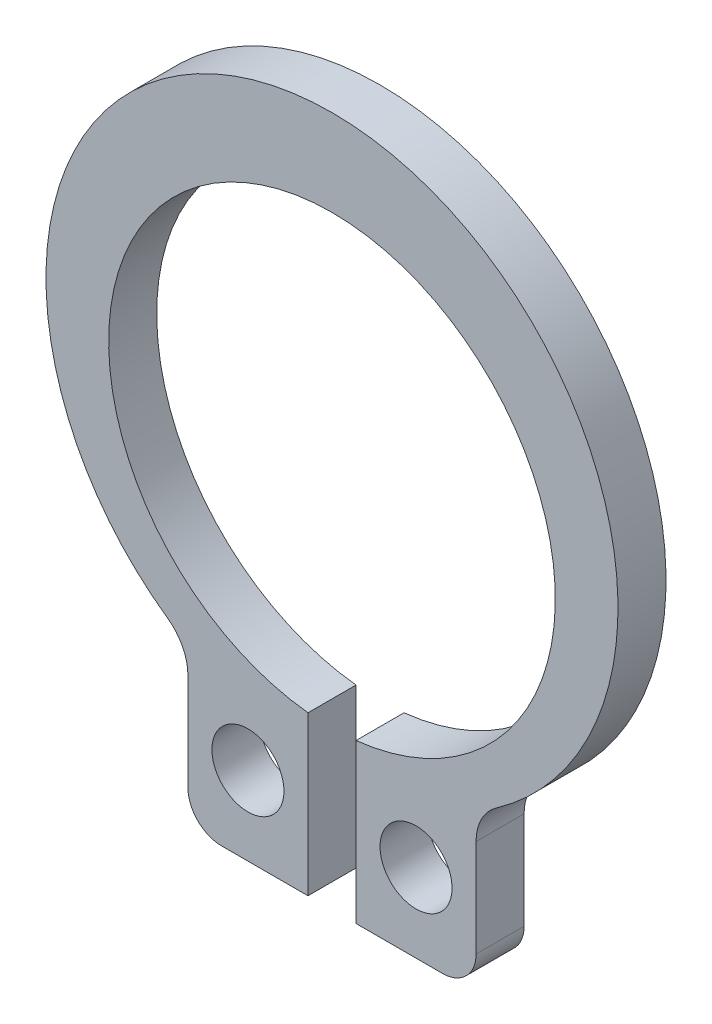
ISO-10303-21;
HEADER;
FILE_DESCRIPTION(('STEP AP214'),'2;1');
FILE_NAME('part.step','',(''),(''),'','','');
FILE_SCHEMA(('AUTOMOTIVE_DESIGN { 1 0 10303 214 1 1 1 1 }'));
ENDSEC;
DATA;
#1=APPLICATION_CONTEXT('core data for automotive mechanical design processes');
#2=APPLICATION_PROTOCOL_DEFINITION('international standard','automotive_design',2000,#1);
#3=PRODUCT_CONTEXT('',#1,'mechanical');
#4=PRODUCT('Part','Part','',(#3));
#5=PRODUCT_RELATED_PRODUCT_CATEGORY('part','',(#4));
#6=PRODUCT_DEFINITION_FORMATION('','',#4);
#7=PRODUCT_DEFINITION_CONTEXT('part definition',#1,'design');
#8=PRODUCT_DEFINITION('design','',#6,#7);
#9=PRODUCT_DEFINITION_SHAPE('','',#8);
#10=(LENGTH_UNIT() NAMED_UNIT(*) SI_UNIT(.MILLI.,.METRE.));
#11=(NAMED_UNIT(*) PLANE_ANGLE_UNIT() SI_UNIT($,.RADIAN.));
#12=(NAMED_UNIT(*) SI_UNIT($,.STERADIAN.) SOLID_ANGLE_UNIT());
#13=UNCERTAINTY_MEASURE_WITH_UNIT(LENGTH_MEASURE(1.E-05),#10,'distance_accuracy_value','');
#14=(GEOMETRIC_REPRESENTATION_CONTEXT(3) GLOBAL_UNCERTAINTY_ASSIGNED_CONTEXT((#13)) GLOBAL_UNIT_ASSIGNED_CONTEXT((#10,
#11,#12)) REPRESENTATION_CONTEXT('',''));
#15=CARTESIAN_POINT('',(0.,0.,0.));
#16=DIRECTION('',(0.,0.,1.));
#17=DIRECTION('',(1.,0.,0.));
#18=AXIS2_PLACEMENT_3D('',#15,#16,#17);
#19=CARTESIAN_POINT('',(0.,0.,1.));
#20=DIRECTION('',(0.,0.,1.));
#21=DIRECTION('',(1.,0.,0.));
#22=AXIS2_PLACEMENT_3D('',#19,#20,#21);
#23=PLANE('',#22);
#24=CARTESIAN_POINT('',(-1.75,-6.28608270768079,1.));
#25=DIRECTION('',(0.,0.,1.));
#26=DIRECTION('',(1.,0.,0.));
#27=AXIS2_PLACEMENT_3D('',#24,#25,#26);
#28=CIRCLE('',#27,0.75);
#29=CARTESIAN_POINT('',(-0.999999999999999,-6.28608270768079,1.));
#30=VERTEX_POINT('',#29);
#31=EDGE_CURVE('E216',#30,#30,#28,.T.);
#32=ORIENTED_EDGE('',*,*,#31,.F.);
#33=EDGE_LOOP('',(#32));
#34=FACE_BOUND('',#33,.T.);
#35=DIRECTION('',(1.,0.,0.));
#36=VECTOR('',#35,1.);
#37=CARTESIAN_POINT('',(0.500000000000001,-7.92304012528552,1.));
#38=LINE('',#37,#36);
#39=CARTESIAN_POINT('',(0.500000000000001,-7.92304012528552,1.));
#40=VERTEX_POINT('',#39);
#41=CARTESIAN_POINT('',(2.3,-7.92304012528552,1.));
#42=VERTEX_POINT('',#41);
#43=EDGE_CURVE('E132',#40,#42,#38,.T.);
#44=ORIENTED_EDGE('',*,*,#43,.T.);
#45=CARTESIAN_POINT('',(2.3,-7.22304012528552,1.));
#46=DIRECTION('',(0.,0.,1.));
#47=DIRECTION('',(1.,0.,0.));
#48=AXIS2_PLACEMENT_3D('',#45,#46,#47);
#49=CIRCLE('',#48,0.7);
#50=CARTESIAN_POINT('',(3.,-7.22304012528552,1.));
#51=VERTEX_POINT('',#50);
#52=EDGE_CURVE('E182',#42,#51,#49,.T.);
#53=ORIENTED_EDGE('',*,*,#52,.T.);
#54=DIRECTION('',(0.,1.,0.));
#55=VECTOR('',#54,1.);
#56=CARTESIAN_POINT('',(3.,-7.92304012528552,1.));
#57=LINE('',#56,#55);
#58=CARTESIAN_POINT('',(3.,-5.19464190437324,1.));
#59=VERTEX_POINT('',#58);
#60=EDGE_CURVE('E236',#51,#59,#57,.T.);
#61=ORIENTED_EDGE('',*,*,#60,.T.);
#62=CARTESIAN_POINT('',(4.,-5.19464190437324,1.));
#63=DIRECTION('',(0.,0.,1.));
#64=DIRECTION('',(1.,0.,0.));
#65=AXIS2_PLACEMENT_3D('',#62,#63,#64);
#66=CIRCLE('',#65,1.);
#67=CARTESIAN_POINT('',(3.42487419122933,-4.37657692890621,1.));
#68=VERTEX_POINT('',#67);
#69=EDGE_CURVE('E166',#59,#68,#66,.F.);
#70=ORIENTED_EDGE('',*,*,#69,.T.);
#71=CARTESIAN_POINT('',(0.,0.495,1.));
#72=DIRECTION('',(0.,0.,1.));
#73=DIRECTION('',(1.,0.,0.));
#74=AXIS2_PLACEMENT_3D('',#71,#72,#73);
#75=CIRCLE('',#74,5.955);
#76=CARTESIAN_POINT('',(-3.42487419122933,-4.37657692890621,1.));
#77=VERTEX_POINT('',#76);
#78=EDGE_CURVE('E234',#68,#77,#75,.T.);
#79=ORIENTED_EDGE('',*,*,#78,.T.);
#80=CARTESIAN_POINT('',(-4.,-5.19464190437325,1.));
#81=DIRECTION('',(0.,0.,1.));
#82=DIRECTION('',(1.,0.,0.));
#83=AXIS2_PLACEMENT_3D('',#80,#81,#82);
#84=CIRCLE('',#83,1.);
#85=CARTESIAN_POINT('',(-3.,-5.19464190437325,1.));
#86=VERTEX_POINT('',#85);
#87=EDGE_CURVE('E170',#77,#86,#84,.F.);
#88=ORIENTED_EDGE('',*,*,#87,.T.);
#89=DIRECTION('',(0.,-1.,0.));
#90=VECTOR('',#89,1.);
#91=CARTESIAN_POINT('',(-3.,-7.92304012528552,1.));
#92=LINE('',#91,#90);
#93=CARTESIAN_POINT('',(-3.,-7.22304012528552,1.));
#94=VERTEX_POINT('',#93);
#95=EDGE_CURVE('E210',#86,#94,#92,.T.);
#96=ORIENTED_EDGE('',*,*,#95,.T.);
#97=CARTESIAN_POINT('',(-2.3,-7.22304012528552,1.));
#98=DIRECTION('',(0.,0.,1.));
#99=DIRECTION('',(1.,0.,0.));
#100=AXIS2_PLACEMENT_3D('',#97,#98,#99);
#101=CIRCLE('',#100,0.7);
#102=CARTESIAN_POINT('',(-2.3,-7.92304012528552,1.));
#103=VERTEX_POINT('',#102);
#104=EDGE_CURVE('E48',#94,#103,#101,.T.);
#105=ORIENTED_EDGE('',*,*,#104,.T.);
#106=DIRECTION('',(1.,0.,0.));
#107=VECTOR('',#106,1.);
#108=CARTESIAN_POINT('',(-0.499999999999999,-7.92304012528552,1.));
#109=LINE('',#108,#107);
#110=CARTESIAN_POINT('',(-0.499999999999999,-7.92304012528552,1.));
#111=VERTEX_POINT('',#110);
#112=EDGE_CURVE('E191',#103,#111,#109,.T.);
#113=ORIENTED_EDGE('',*,*,#112,.T.);
#114=DIRECTION('',(0.,1.,0.));
#115=VECTOR('',#114,1.);
#116=CARTESIAN_POINT('',(-0.499999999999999,-4.62304012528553,1.));
#117=LINE('',#116,#115);
#118=CARTESIAN_POINT('',(-0.499999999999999,-4.62304012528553,1.));
#119=VERTEX_POINT('',#118);
#120=EDGE_CURVE('E138',#111,#119,#117,.T.);
#121=ORIENTED_EDGE('',*,*,#120,.T.);
#122=CARTESIAN_POINT('',(0.,0.,1.));
#123=DIRECTION('',(0.,0.,-1.));
#124=DIRECTION('',(1.,0.,0.));
#125=AXIS2_PLACEMENT_3D('',#122,#123,#124);
#126=CIRCLE('',#125,4.65);
#127=CARTESIAN_POINT('',(0.499999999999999,-4.62304012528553,1.));
#128=VERTEX_POINT('',#127);
#129=EDGE_CURVE('E133',#119,#128,#126,.T.);
#130=ORIENTED_EDGE('',*,*,#129,.T.);
#131=DIRECTION('',(0.,-1.,0.));
#132=VECTOR('',#131,1.);
#133=CARTESIAN_POINT('',(0.499999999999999,-4.62304012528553,1.));
#134=LINE('',#133,#132);
#135=EDGE_CURVE('E122',#128,#40,#134,.T.);
#136=ORIENTED_EDGE('',*,*,#135,.T.);
#137=EDGE_LOOP('',(#44,#53,#61,#70,#79,#88,#96,#105,#113,#121,#130,#136));
#138=FACE_BOUND('',#137,.T.);
#139=CARTESIAN_POINT('',(1.75,-6.28608270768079,1.));
#140=DIRECTION('',(0.,0.,1.));
#141=DIRECTION('',(-1.,0.,0.));
#142=AXIS2_PLACEMENT_3D('',#139,#140,#141);
#143=CIRCLE('',#142,0.75);
#144=CARTESIAN_POINT('',(1.,-6.28608270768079,1.));
#145=VERTEX_POINT('',#144);
#146=EDGE_CURVE('E244',#145,#145,#143,.T.);
#147=ORIENTED_EDGE('',*,*,#146,.F.);
#148=EDGE_LOOP('',(#147));
#149=FACE_BOUND('',#148,.T.);
#150=ADVANCED_FACE('F33',(#34,#138,#149),#23,.T.);
#151=CARTESIAN_POINT('',(0.,0.,0.));
#152=DIRECTION('',(0.,0.,1.));
#153=DIRECTION('',(1.,0.,0.));
#154=AXIS2_PLACEMENT_3D('',#151,#152,#153);
#155=PLANE('',#154);
#156=DIRECTION('',(0.,1.,0.));
#157=VECTOR('',#156,1.);
#158=CARTESIAN_POINT('',(3.,-7.92304012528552,0.));
#159=LINE('',#158,#157);
#160=CARTESIAN_POINT('',(3.,-7.22304012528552,0.));
#161=VERTEX_POINT('',#160);
#162=CARTESIAN_POINT('',(3.,-5.19464190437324,0.));
#163=VERTEX_POINT('',#162);
#164=EDGE_CURVE('E221',#161,#163,#159,.T.);
#165=ORIENTED_EDGE('',*,*,#164,.F.);
#166=CARTESIAN_POINT('',(2.3,-7.22304012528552,0.));
#167=DIRECTION('',(0.,0.,1.));
#168=DIRECTION('',(1.,0.,0.));
#169=AXIS2_PLACEMENT_3D('',#166,#167,#168);
#170=CIRCLE('',#169,0.7);
#171=CARTESIAN_POINT('',(2.3,-7.92304012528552,0.));
#172=VERTEX_POINT('',#171);
#173=EDGE_CURVE('E177',#161,#172,#170,.F.);
#174=ORIENTED_EDGE('',*,*,#173,.T.);
#175=DIRECTION('',(1.,0.,0.));
#176=VECTOR('',#175,1.);
#177=CARTESIAN_POINT('',(0.500000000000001,-7.92304012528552,0.));
#178=LINE('',#177,#176);
#179=CARTESIAN_POINT('',(0.500000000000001,-7.92304012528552,0.));
#180=VERTEX_POINT('',#179);
#181=EDGE_CURVE('E218',#180,#172,#178,.T.);
#182=ORIENTED_EDGE('',*,*,#181,.F.);
#183=DIRECTION('',(0.,-1.,0.));
#184=VECTOR('',#183,1.);
#185=CARTESIAN_POINT('',(0.499999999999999,-4.62304012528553,0.));
#186=LINE('',#185,#184);
#187=CARTESIAN_POINT('',(0.499999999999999,-4.62304012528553,0.));
#188=VERTEX_POINT('',#187);
#189=EDGE_CURVE('E215',#188,#180,#186,.T.);
#190=ORIENTED_EDGE('',*,*,#189,.F.);
#191=CARTESIAN_POINT('',(0.,0.,0.));
#192=DIRECTION('',(0.,0.,-1.));
#193=DIRECTION('',(1.,0.,0.));
#194=AXIS2_PLACEMENT_3D('',#191,#192,#193);
#195=CIRCLE('',#194,4.65);
#196=CARTESIAN_POINT('',(-0.499999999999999,-4.62304012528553,0.));
#197=VERTEX_POINT('',#196);
#198=EDGE_CURVE('E146',#197,#188,#195,.T.);
#199=ORIENTED_EDGE('',*,*,#198,.F.);
#200=DIRECTION('',(0.,1.,0.));
#201=VECTOR('',#200,1.);
#202=CARTESIAN_POINT('',(-0.499999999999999,-4.62304012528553,0.));
#203=LINE('',#202,#201);
#204=CARTESIAN_POINT('',(-0.499999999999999,-7.92304012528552,0.));
#205=VERTEX_POINT('',#204);
#206=EDGE_CURVE('E142',#205,#197,#203,.T.);
#207=ORIENTED_EDGE('',*,*,#206,.F.);
#208=DIRECTION('',(1.,0.,0.));
#209=VECTOR('',#208,1.);
#210=CARTESIAN_POINT('',(-0.499999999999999,-7.92304012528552,0.));
#211=LINE('',#210,#209);
#212=CARTESIAN_POINT('',(-2.3,-7.92304012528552,0.));
#213=VERTEX_POINT('',#212);
#214=EDGE_CURVE('E189',#213,#205,#211,.T.);
#215=ORIENTED_EDGE('',*,*,#214,.F.);
#216=CARTESIAN_POINT('',(-2.3,-7.22304012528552,0.));
#217=DIRECTION('',(0.,0.,1.));
#218=DIRECTION('',(1.,0.,0.));
#219=AXIS2_PLACEMENT_3D('',#216,#217,#218);
#220=CIRCLE('',#219,0.7);
#221=CARTESIAN_POINT('',(-3.,-7.22304012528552,0.));
#222=VERTEX_POINT('',#221);
#223=EDGE_CURVE('E175',#213,#222,#220,.F.);
#224=ORIENTED_EDGE('',*,*,#223,.T.);
#225=DIRECTION('',(0.,-1.,0.));
#226=VECTOR('',#225,1.);
#227=CARTESIAN_POINT('',(-3.,-7.92304012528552,0.));
#228=LINE('',#227,#226);
#229=CARTESIAN_POINT('',(-3.,-5.19464190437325,0.));
#230=VERTEX_POINT('',#229);
#231=EDGE_CURVE('E199',#230,#222,#228,.T.);
#232=ORIENTED_EDGE('',*,*,#231,.F.);
#233=CARTESIAN_POINT('',(-4.,-5.19464190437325,0.));
#234=DIRECTION('',(0.,0.,1.));
#235=DIRECTION('',(1.,0.,0.));
#236=AXIS2_PLACEMENT_3D('',#233,#234,#235);
#237=CIRCLE('',#236,1.);
#238=CARTESIAN_POINT('',(-3.42487419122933,-4.37657692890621,0.));
#239=VERTEX_POINT('',#238);
#240=EDGE_CURVE('E168',#230,#239,#237,.T.);
#241=ORIENTED_EDGE('',*,*,#240,.T.);
#242=CARTESIAN_POINT('',(0.,0.495,0.));
#243=DIRECTION('',(0.,0.,1.));
#244=DIRECTION('',(1.,0.,0.));
#245=AXIS2_PLACEMENT_3D('',#242,#243,#244);
#246=CIRCLE('',#245,5.955);
#247=CARTESIAN_POINT('',(3.42487419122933,-4.37657692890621,0.));
#248=VERTEX_POINT('',#247);
#249=EDGE_CURVE('E202',#248,#239,#246,.T.);
#250=ORIENTED_EDGE('',*,*,#249,.F.);
#251=CARTESIAN_POINT('',(4.,-5.19464190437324,0.));
#252=DIRECTION('',(0.,0.,1.));
#253=DIRECTION('',(1.,0.,0.));
#254=AXIS2_PLACEMENT_3D('',#251,#252,#253);
#255=CIRCLE('',#254,1.);
#256=EDGE_CURVE('E163',#248,#163,#255,.T.);
#257=ORIENTED_EDGE('',*,*,#256,.T.);
#258=EDGE_LOOP('',(#165,#174,#182,#190,#199,#207,#215,#224,#232,#241,#250,#257));
#259=FACE_BOUND('',#258,.T.);
#260=CARTESIAN_POINT('',(-1.75,-6.28608270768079,0.));
#261=DIRECTION('',(0.,0.,1.));
#262=DIRECTION('',(1.,0.,0.));
#263=AXIS2_PLACEMENT_3D('',#260,#261,#262);
#264=CIRCLE('',#263,0.75);
#265=CARTESIAN_POINT('',(-0.999999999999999,-6.28608270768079,0.));
#266=VERTEX_POINT('',#265);
#267=EDGE_CURVE('E241',#266,#266,#264,.T.);
#268=ORIENTED_EDGE('',*,*,#267,.T.);
#269=EDGE_LOOP('',(#268));
#270=FACE_BOUND('',#269,.T.);
#271=CARTESIAN_POINT('',(1.75,-6.28608270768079,0.));
#272=DIRECTION('',(0.,0.,1.));
#273=DIRECTION('',(-1.,0.,0.));
#274=AXIS2_PLACEMENT_3D('',#271,#272,#273);
#275=CIRCLE('',#274,0.75);
#276=CARTESIAN_POINT('',(1.,-6.28608270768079,0.));
#277=VERTEX_POINT('',#276);
#278=EDGE_CURVE('E247',#277,#277,#275,.T.);
#279=ORIENTED_EDGE('',*,*,#278,.T.);
#280=EDGE_LOOP('',(#279));
#281=FACE_BOUND('',#280,.T.);
#282=ADVANCED_FACE('F196',(#259,#270,#281),#155,.F.);
#283=CARTESIAN_POINT('',(0.,0.,1.));
#284=DIRECTION('',(0.,0.,-1.));
#285=DIRECTION('',(-1.,0.,0.));
#286=AXIS2_PLACEMENT_3D('',#283,#284,#285);
#287=CYLINDRICAL_SURFACE('',#286,4.65);
#288=ORIENTED_EDGE('',*,*,#198,.T.);
#289=DIRECTION('',(0.,0.,-1.));
#290=VECTOR('',#289,1.);
#291=CARTESIAN_POINT('',(0.499999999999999,-4.62304012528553,1.));
#292=LINE('',#291,#290);
#293=EDGE_CURVE('E126',#128,#188,#292,.T.);
#294=ORIENTED_EDGE('',*,*,#293,.F.);
#295=ORIENTED_EDGE('',*,*,#129,.F.);
#296=DIRECTION('',(0.,0.,-1.));
#297=VECTOR('',#296,1.);
#298=CARTESIAN_POINT('',(-0.499999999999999,-4.62304012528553,1.));
#299=LINE('',#298,#297);
#300=EDGE_CURVE('E206',#119,#197,#299,.T.);
#301=ORIENTED_EDGE('',*,*,#300,.T.);
#302=EDGE_LOOP('',(#288,#294,#295,#301));
#303=FACE_BOUND('',#302,.T.);
#304=ADVANCED_FACE('F144',(#303),#287,.F.);
#305=CARTESIAN_POINT('',(0.499999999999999,-4.62304012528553,1.));
#306=DIRECTION('',(1.,0.,0.));
#307=DIRECTION('',(0.,1.,0.));
#308=AXIS2_PLACEMENT_3D('',#305,#306,#307);
#309=PLANE('',#308);
#310=ORIENTED_EDGE('',*,*,#189,.T.);
#311=DIRECTION('',(0.,0.,-1.));
#312=VECTOR('',#311,1.);
#313=CARTESIAN_POINT('',(0.500000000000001,-7.92304012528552,1.));
#314=LINE('',#313,#312);
#315=EDGE_CURVE('E129',#40,#180,#314,.T.);
#316=ORIENTED_EDGE('',*,*,#315,.F.);
#317=ORIENTED_EDGE('',*,*,#135,.F.);
#318=ORIENTED_EDGE('',*,*,#293,.T.);
#319=EDGE_LOOP('',(#310,#316,#317,#318));
#320=FACE_BOUND('',#319,.T.);
#321=ADVANCED_FACE('F124',(#320),#309,.F.);
#322=CARTESIAN_POINT('',(0.500000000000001,-7.92304012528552,1.));
#323=DIRECTION('',(0.,1.,0.));
#324=DIRECTION('',(0.,0.,1.));
#325=AXIS2_PLACEMENT_3D('',#322,#323,#324);
#326=PLANE('',#325);
#327=ORIENTED_EDGE('',*,*,#181,.T.);
#328=DIRECTION('',(0.,0.,-1.));
#329=VECTOR('',#328,1.);
#330=CARTESIAN_POINT('',(2.3,-7.92304012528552,1.));
#331=LINE('',#330,#329);
#332=EDGE_CURVE('E179',#172,#42,#331,.F.);
#333=ORIENTED_EDGE('',*,*,#332,.T.);
#334=ORIENTED_EDGE('',*,*,#43,.F.);
#335=ORIENTED_EDGE('',*,*,#315,.T.);
#336=EDGE_LOOP('',(#327,#333,#334,#335));
#337=FACE_BOUND('',#336,.T.);
#338=ADVANCED_FACE('F278',(#337),#326,.F.);
#339=CARTESIAN_POINT('',(3.,-7.92304012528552,1.));
#340=DIRECTION('',(-1.,0.,0.));
#341=DIRECTION('',(0.,0.,1.));
#342=AXIS2_PLACEMENT_3D('',#339,#340,#341);
#343=PLANE('',#342);
#344=ORIENTED_EDGE('',*,*,#60,.F.);
#345=DIRECTION('',(0.,0.,-1.));
#346=VECTOR('',#345,1.);
#347=CARTESIAN_POINT('',(3.,-7.22304012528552,1.));
#348=LINE('',#347,#346);
#349=EDGE_CURVE('E172',#51,#161,#348,.T.);
#350=ORIENTED_EDGE('',*,*,#349,.T.);
#351=ORIENTED_EDGE('',*,*,#164,.T.);
#352=DIRECTION('',(0.,0.,1.));
#353=VECTOR('',#352,1.);
#354=CARTESIAN_POINT('',(3.,-5.19464190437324,1.));
#355=LINE('',#354,#353);
#356=EDGE_CURVE('E157',#163,#59,#355,.T.);
#357=ORIENTED_EDGE('',*,*,#356,.T.);
#358=EDGE_LOOP('',(#344,#350,#351,#357));
#359=FACE_BOUND('',#358,.T.);
#360=ADVANCED_FACE('F275',(#359),#343,.F.);
#361=CARTESIAN_POINT('',(0.,0.495,1.));
#362=DIRECTION('',(0.,0.,-1.));
#363=DIRECTION('',(-1.,0.,0.));
#364=AXIS2_PLACEMENT_3D('',#361,#362,#363);
#365=CYLINDRICAL_SURFACE('',#364,5.955);
#366=ORIENTED_EDGE('',*,*,#78,.F.);
#367=DIRECTION('',(0.,0.,-1.));
#368=VECTOR('',#367,1.);
#369=CARTESIAN_POINT('',(3.42487419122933,-4.37657692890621,1.));
#370=LINE('',#369,#368);
#371=EDGE_CURVE('E149',#68,#248,#370,.T.);
#372=ORIENTED_EDGE('',*,*,#371,.T.);
#373=ORIENTED_EDGE('',*,*,#249,.T.);
#374=DIRECTION('',(0.,0.,-1.));
#375=VECTOR('',#374,1.);
#376=CARTESIAN_POINT('',(-3.42487419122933,-4.37657692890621,1.));
#377=LINE('',#376,#375);
#378=EDGE_CURVE('E147',#239,#77,#377,.F.);
#379=ORIENTED_EDGE('',*,*,#378,.T.);
#380=EDGE_LOOP('',(#366,#372,#373,#379));
#381=FACE_BOUND('',#380,.T.);
#382=ADVANCED_FACE('F227',(#381),#365,.T.);
#383=CARTESIAN_POINT('',(-3.,-7.92304012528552,1.));
#384=DIRECTION('',(1.,0.,0.));
#385=DIRECTION('',(0.,0.,-1.));
#386=AXIS2_PLACEMENT_3D('',#383,#384,#385);
#387=PLANE('',#386);
#388=ORIENTED_EDGE('',*,*,#231,.T.);
#389=DIRECTION('',(0.,0.,-1.));
#390=VECTOR('',#389,1.);
#391=CARTESIAN_POINT('',(-3.,-7.22304012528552,1.));
#392=LINE('',#391,#390);
#393=EDGE_CURVE('E11',#222,#94,#392,.F.);
#394=ORIENTED_EDGE('',*,*,#393,.T.);
#395=ORIENTED_EDGE('',*,*,#95,.F.);
#396=DIRECTION('',(0.,0.,1.));
#397=VECTOR('',#396,1.);
#398=CARTESIAN_POINT('',(-3.,-5.19464190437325,0.));
#399=LINE('',#398,#397);
#400=EDGE_CURVE('E160',#86,#230,#399,.F.);
#401=ORIENTED_EDGE('',*,*,#400,.T.);
#402=EDGE_LOOP('',(#388,#394,#395,#401));
#403=FACE_BOUND('',#402,.T.);
#404=ADVANCED_FACE('F235',(#403),#387,.F.);
#405=CARTESIAN_POINT('',(-0.499999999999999,-7.92304012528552,1.));
#406=DIRECTION('',(0.,1.,0.));
#407=DIRECTION('',(0.,0.,1.));
#408=AXIS2_PLACEMENT_3D('',#405,#406,#407);
#409=PLANE('',#408);
#410=ORIENTED_EDGE('',*,*,#112,.F.);
#411=DIRECTION('',(0.,0.,-1.));
#412=VECTOR('',#411,1.);
#413=CARTESIAN_POINT('',(-2.3,-7.92304012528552,1.));
#414=LINE('',#413,#412);
#415=EDGE_CURVE('E41',#103,#213,#414,.T.);
#416=ORIENTED_EDGE('',*,*,#415,.T.);
#417=ORIENTED_EDGE('',*,*,#214,.T.);
#418=DIRECTION('',(0.,0.,-1.));
#419=VECTOR('',#418,1.);
#420=CARTESIAN_POINT('',(-0.499999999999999,-7.92304012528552,1.));
#421=LINE('',#420,#419);
#422=EDGE_CURVE('E151',#111,#205,#421,.T.);
#423=ORIENTED_EDGE('',*,*,#422,.F.);
#424=EDGE_LOOP('',(#410,#416,#417,#423));
#425=FACE_BOUND('',#424,.T.);
#426=ADVANCED_FACE('F187',(#425),#409,.F.);
#427=CARTESIAN_POINT('',(-0.499999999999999,-4.62304012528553,1.));
#428=DIRECTION('',(-1.,0.,0.));
#429=DIRECTION('',(0.,-1.,0.));
#430=AXIS2_PLACEMENT_3D('',#427,#428,#429);
#431=PLANE('',#430);
#432=ORIENTED_EDGE('',*,*,#206,.T.);
#433=ORIENTED_EDGE('',*,*,#300,.F.);
#434=ORIENTED_EDGE('',*,*,#120,.F.);
#435=ORIENTED_EDGE('',*,*,#422,.T.);
#436=EDGE_LOOP('',(#432,#433,#434,#435));
#437=FACE_BOUND('',#436,.T.);
#438=ADVANCED_FACE('F208',(#437),#431,.F.);
#439=CARTESIAN_POINT('',(-1.75,-6.28608270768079,1.));
#440=DIRECTION('',(0.,0.,-1.));
#441=DIRECTION('',(-1.,0.,0.));
#442=AXIS2_PLACEMENT_3D('',#439,#440,#441);
#443=CYLINDRICAL_SURFACE('',#442,0.75);
#444=ORIENTED_EDGE('',*,*,#31,.T.);
#445=EDGE_LOOP('',(#444));
#446=FACE_BOUND('',#445,.T.);
#447=ORIENTED_EDGE('',*,*,#267,.F.);
#448=EDGE_LOOP('',(#447));
#449=FACE_BOUND('',#448,.T.);
#450=ADVANCED_FACE('F264',(#446,#449),#443,.F.);
#451=CARTESIAN_POINT('',(1.75,-6.28608270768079,1.));
#452=DIRECTION('',(0.,0.,-1.));
#453=DIRECTION('',(-1.,0.,0.));
#454=AXIS2_PLACEMENT_3D('',#451,#452,#453);
#455=CYLINDRICAL_SURFACE('',#454,0.75);
#456=ORIENTED_EDGE('',*,*,#146,.T.);
#457=EDGE_LOOP('',(#456));
#458=FACE_BOUND('',#457,.T.);
#459=ORIENTED_EDGE('',*,*,#278,.F.);
#460=EDGE_LOOP('',(#459));
#461=FACE_BOUND('',#460,.T.);
#462=ADVANCED_FACE('F253',(#458,#461),#455,.F.);
#463=CARTESIAN_POINT('',(4.,-5.19464190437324,1.));
#464=DIRECTION('',(0.,0.,-1.));
#465=DIRECTION('',(-1.,0.,0.));
#466=AXIS2_PLACEMENT_3D('',#463,#464,#465);
#467=CYLINDRICAL_SURFACE('',#466,1.);
#468=ORIENTED_EDGE('',*,*,#69,.F.);
#469=ORIENTED_EDGE('',*,*,#356,.F.);
#470=ORIENTED_EDGE('',*,*,#256,.F.);
#471=ORIENTED_EDGE('',*,*,#371,.F.);
#472=EDGE_LOOP('',(#468,#469,#470,#471));
#473=FACE_BOUND('',#472,.T.);
#474=ADVANCED_FACE('F287',(#473),#467,.F.);
#475=CARTESIAN_POINT('',(-4.,-5.19464190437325,1.));
#476=DIRECTION('',(0.,0.,-1.));
#477=DIRECTION('',(-1.,0.,0.));
#478=AXIS2_PLACEMENT_3D('',#475,#476,#477);
#479=CYLINDRICAL_SURFACE('',#478,1.);
#480=ORIENTED_EDGE('',*,*,#87,.F.);
#481=ORIENTED_EDGE('',*,*,#378,.F.);
#482=ORIENTED_EDGE('',*,*,#240,.F.);
#483=ORIENTED_EDGE('',*,*,#400,.F.);
#484=EDGE_LOOP('',(#480,#481,#482,#483));
#485=FACE_BOUND('',#484,.T.);
#486=ADVANCED_FACE('F232',(#485),#479,.F.);
#487=CARTESIAN_POINT('',(2.3,-7.22304012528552,1.));
#488=DIRECTION('',(0.,0.,-1.));
#489=DIRECTION('',(-1.,0.,0.));
#490=AXIS2_PLACEMENT_3D('',#487,#488,#489);
#491=CYLINDRICAL_SURFACE('',#490,0.7);
#492=ORIENTED_EDGE('',*,*,#52,.F.);
#493=ORIENTED_EDGE('',*,*,#332,.F.);
#494=ORIENTED_EDGE('',*,*,#173,.F.);
#495=ORIENTED_EDGE('',*,*,#349,.F.);
#496=EDGE_LOOP('',(#492,#493,#494,#495));
#497=FACE_BOUND('',#496,.T.);
#498=ADVANCED_FACE('F292',(#497),#491,.T.);
#499=CARTESIAN_POINT('',(-2.3,-7.22304012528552,1.));
#500=DIRECTION('',(0.,0.,-1.));
#501=DIRECTION('',(-1.,0.,0.));
#502=AXIS2_PLACEMENT_3D('',#499,#500,#501);
#503=CYLINDRICAL_SURFACE('',#502,0.7);
#504=ORIENTED_EDGE('',*,*,#104,.F.);
#505=ORIENTED_EDGE('',*,*,#393,.F.);
#506=ORIENTED_EDGE('',*,*,#223,.F.);
#507=ORIENTED_EDGE('',*,*,#415,.F.);
#508=EDGE_LOOP('',(#504,#505,#506,#507));
#509=FACE_BOUND('',#508,.T.);
#510=ADVANCED_FACE('F35',(#509),#503,.T.);
#511=CLOSED_SHELL('',(#150,#282,#304,#321,#338,#360,#382,#404,#426,#438,#450,#462,#474,#486,
#498,#510));
#512=MANIFOLD_SOLID_BREP('B2',#511);
#513=ADVANCED_BREP_SHAPE_REPRESENTATION('',(#18,#512),#14);
#514=SHAPE_DEFINITION_REPRESENTATION(#9,#513);
ENDSEC;
END-ISO-10303-21;
